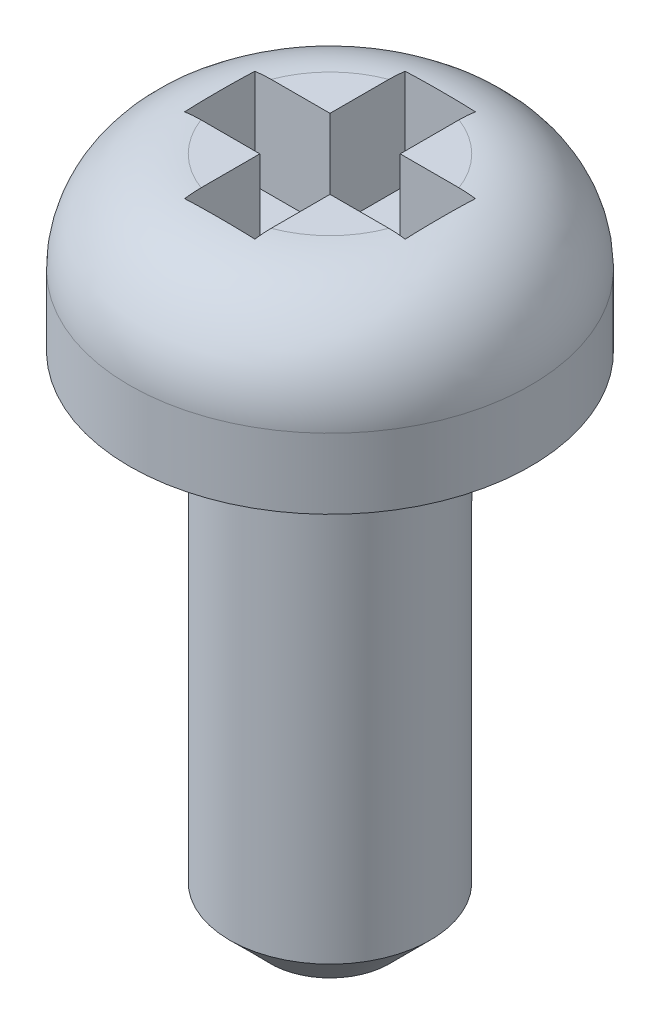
from build123d import *

# Parameters (mm, degrees)
SKETCH2_W               = 0.7
SKETCH2_H               = 2.2
CUT_EXTRUDE_THIN2_DEPTH = 1
CIRPATTERN1_COUNT       = 2
CIRPATTERN1_ANGLE       = 90
SKETCH3_R               = 1
BOSS_EXTRUDE1_DEPTH     = 5
FILLET1_R               = 0.4572
CHAMFER1_SIZE           = 0.4064


with BuildPart() as part:
    # Sketch1 → Base-Revolve (revolve)
    with BuildSketch(Plane.XY, mode=Mode.PRIVATE) as base_revolve_sk:
        with BuildLine():
            Line((2, 0), (0, 0))
            Line((0, 0), (0, 1.7))
            Line((0, 1.7), (1, 1.7))
            ThreePointArc((1, 1.7), (1.707106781, 1.407106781), (2, 0.7))
            Line((2, 0.7), (2, 0))
        make_face()
    revolve(base_revolve_sk.sketch.rotate(Axis((0, 11.592517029, 0), (0, -1, 0)), 90), axis=Axis((0, 11.592517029, 0), (0, -1, 0)))

    # Sketch2 → Cut-Extrude-Thin2 (cut)
    with BuildSketch(Plane(origin=(0, 1.7, 0), x_dir=(-1, 0, 0), z_dir=(0, 1, 0))):
        Rectangle(SKETCH2_W, SKETCH2_H)
    cut_extrude_thin2 = extrude(amount=-CUT_EXTRUDE_THIN2_DEPTH, mode=Mode.SUBTRACT)

    # CirPattern1: Cut-Extrude-Thin2 ×2 about axis
    cirpattern1_axis = Axis((0, 0, 0), (0, 1, 0))
    for i in range(1, CIRPATTERN1_COUNT):
        add(cut_extrude_thin2.rotate(cirpattern1_axis, i * CIRPATTERN1_ANGLE / (CIRPATTERN1_COUNT - 1)), mode=Mode.SUBTRACT)

    # Sketch3 → Boss-Extrude1 (add)
    with BuildSketch(Plane.XZ):
        with Locations(Location((0, 0, 0), (0, 0, 90))):
            Circle(SKETCH3_R)
    extrude(amount=BOSS_EXTRUDE1_DEPTH)

    # Fillet1
    fillet1_edges = [part.edges().sort_by_distance(p)[0] for p in [
        (0, 0, -1),
    ]]
    fillet(fillet1_edges, radius=FILLET1_R)

    # Chamfer1
    chamfer1_edges = [part.edges().sort_by_distance(p)[0] for p in [
        (0, -5, -1),
    ]]
    chamfer(chamfer1_edges, length=CHAMFER1_SIZE)


solid = part.part
